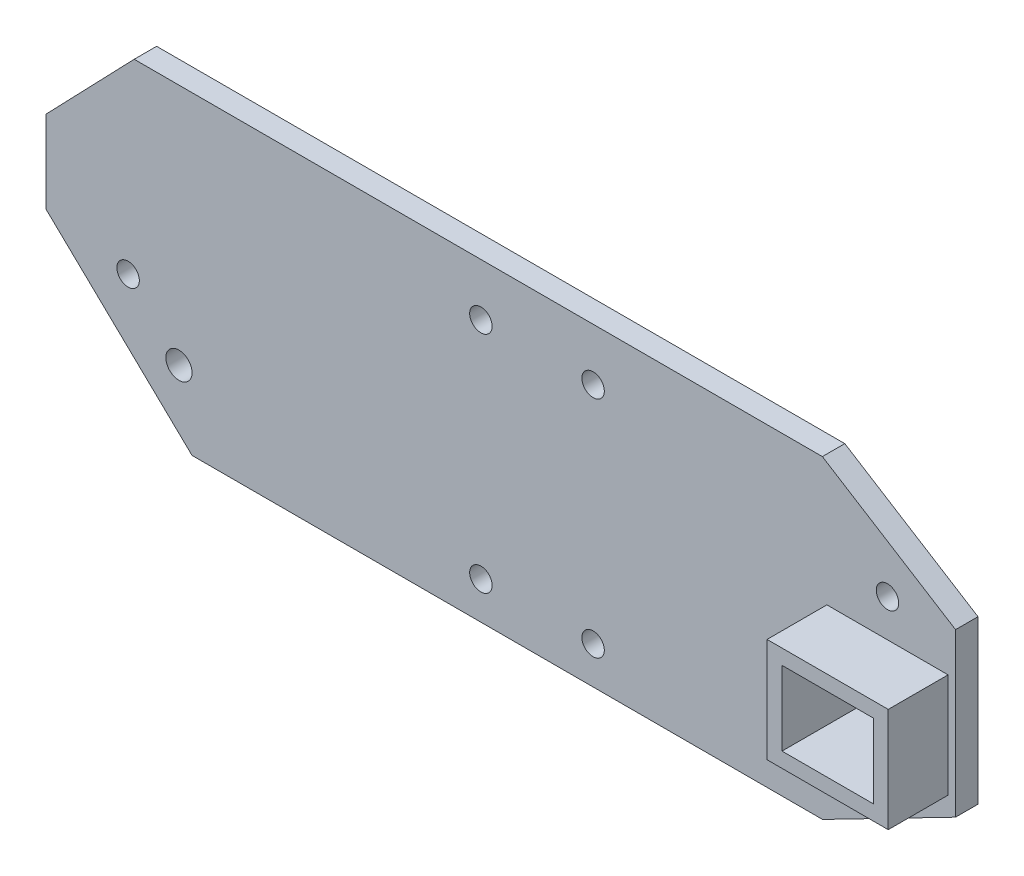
ISO-10303-21;
HEADER;
FILE_DESCRIPTION(('STEP AP214'),'2;1');
FILE_NAME('part.step','',(''),(''),'','','');
FILE_SCHEMA(('AUTOMOTIVE_DESIGN { 1 0 10303 214 1 1 1 1 }'));
ENDSEC;
DATA;
#1=APPLICATION_CONTEXT('core data for automotive mechanical design processes');
#2=APPLICATION_PROTOCOL_DEFINITION('international standard','automotive_design',2000,#1);
#3=PRODUCT_CONTEXT('',#1,'mechanical');
#4=PRODUCT('Part','Part','',(#3));
#5=PRODUCT_RELATED_PRODUCT_CATEGORY('part','',(#4));
#6=PRODUCT_DEFINITION_FORMATION('','',#4);
#7=PRODUCT_DEFINITION_CONTEXT('part definition',#1,'design');
#8=PRODUCT_DEFINITION('design','',#6,#7);
#9=PRODUCT_DEFINITION_SHAPE('','',#8);
#10=(LENGTH_UNIT() NAMED_UNIT(*) SI_UNIT(.MILLI.,.METRE.));
#11=(NAMED_UNIT(*) PLANE_ANGLE_UNIT() SI_UNIT($,.RADIAN.));
#12=(NAMED_UNIT(*) SI_UNIT($,.STERADIAN.) SOLID_ANGLE_UNIT());
#13=UNCERTAINTY_MEASURE_WITH_UNIT(LENGTH_MEASURE(1.E-05),#10,'distance_accuracy_value','');
#14=(GEOMETRIC_REPRESENTATION_CONTEXT(3) GLOBAL_UNCERTAINTY_ASSIGNED_CONTEXT((#13)) GLOBAL_UNIT_ASSIGNED_CONTEXT((#10,
#11,#12)) REPRESENTATION_CONTEXT('',''));
#15=CARTESIAN_POINT('',(0.,0.,0.));
#16=DIRECTION('',(0.,0.,1.));
#17=DIRECTION('',(1.,0.,0.));
#18=AXIS2_PLACEMENT_3D('',#15,#16,#17);
#19=CARTESIAN_POINT('',(0.,0.,3.));
#20=DIRECTION('',(0.,0.,1.));
#21=DIRECTION('',(1.,0.,0.));
#22=AXIS2_PLACEMENT_3D('',#19,#20,#21);
#23=PLANE('',#22);
#24=DIRECTION('',(-0.693449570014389,-0.720505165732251,0.));
#25=VECTOR('',#24,1.);
#26=CARTESIAN_POINT('',(-136.975246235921,26.6257818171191,3.));
#27=LINE('',#26,#25);
#28=CARTESIAN_POINT('',(-125.186603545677,38.8743696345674,3.));
#29=VERTEX_POINT('',#28);
#30=CARTESIAN_POINT('',(-136.975246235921,26.6257818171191,3.));
#31=VERTEX_POINT('',#30);
#32=EDGE_CURVE('E245',#29,#31,#27,.T.);
#33=ORIENTED_EDGE('',*,*,#32,.T.);
#34=DIRECTION('',(0.,-1.,0.));
#35=VECTOR('',#34,1.);
#36=CARTESIAN_POINT('',(-136.975246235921,15.6257818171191,3.));
#37=LINE('',#36,#35);
#38=CARTESIAN_POINT('',(-136.975246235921,15.6257818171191,3.));
#39=VERTEX_POINT('',#38);
#40=EDGE_CURVE('E248',#31,#39,#37,.T.);
#41=ORIENTED_EDGE('',*,*,#40,.T.);
#42=DIRECTION('',(0.721195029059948,-0.692732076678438,0.));
#43=VECTOR('',#42,1.);
#44=CARTESIAN_POINT('',(-117.453376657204,-3.12563036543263,3.));
#45=LINE('',#44,#43);
#46=CARTESIAN_POINT('',(-117.453376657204,-3.12563036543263,3.));
#47=VERTEX_POINT('',#46);
#48=EDGE_CURVE('E251',#39,#47,#45,.T.);
#49=ORIENTED_EDGE('',*,*,#48,.T.);
#50=DIRECTION('',(1.,0.,0.));
#51=VECTOR('',#50,1.);
#52=CARTESIAN_POINT('',(-117.453376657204,-3.12563036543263,3.));
#53=LINE('',#52,#51);
#54=CARTESIAN_POINT('',(-33.1633766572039,-3.12563036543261,3.));
#55=VERTEX_POINT('',#54);
#56=EDGE_CURVE('E253',#47,#55,#53,.T.);
#57=ORIENTED_EDGE('',*,*,#56,.T.);
#58=DIRECTION('',(0.889108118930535,0.457697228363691,0.));
#59=VECTOR('',#58,1.);
#60=CARTESIAN_POINT('',(-15.3812498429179,6.02829589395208,3.));
#61=LINE('',#60,#59);
#62=CARTESIAN_POINT('',(-15.3812498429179,6.02829589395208,3.));
#63=VERTEX_POINT('',#62);
#64=EDGE_CURVE('E255',#55,#63,#61,.T.);
#65=ORIENTED_EDGE('',*,*,#64,.T.);
#66=DIRECTION('',(0.,1.,0.));
#67=VECTOR('',#66,1.);
#68=CARTESIAN_POINT('',(-15.3812498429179,27.7402158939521,3.));
#69=LINE('',#68,#67);
#70=CARTESIAN_POINT('',(-15.3812498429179,27.7402158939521,3.));
#71=VERTEX_POINT('',#70);
#72=EDGE_CURVE('E257',#63,#71,#69,.T.);
#73=ORIENTED_EDGE('',*,*,#72,.T.);
#74=DIRECTION('',(-0.847873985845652,0.530197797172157,0.));
#75=VECTOR('',#74,1.);
#76=CARTESIAN_POINT('',(-33.1866035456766,38.8743696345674,3.));
#77=LINE('',#76,#75);
#78=CARTESIAN_POINT('',(-33.1866035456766,38.8743696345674,3.));
#79=VERTEX_POINT('',#78);
#80=EDGE_CURVE('E259',#71,#79,#77,.T.);
#81=ORIENTED_EDGE('',*,*,#80,.T.);
#82=DIRECTION('',(-1.,0.,0.));
#83=VECTOR('',#82,1.);
#84=CARTESIAN_POINT('',(-125.186603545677,38.8743696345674,3.));
#85=LINE('',#84,#83);
#86=EDGE_CURVE('E261',#79,#29,#85,.T.);
#87=ORIENTED_EDGE('',*,*,#86,.T.);
#88=EDGE_LOOP('',(#33,#41,#49,#57,#65,#73,#81,#87));
#89=FACE_BOUND('',#88,.T.);
#90=CARTESIAN_POINT('',(-24.4812498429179,27.0092558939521,3.));
#91=DIRECTION('',(0.,0.,1.));
#92=DIRECTION('',(1.,0.,0.));
#93=AXIS2_PLACEMENT_3D('',#90,#91,#92);
#94=CIRCLE('',#93,1.5);
#95=CARTESIAN_POINT('',(-22.9812498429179,27.0092558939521,3.));
#96=VERTEX_POINT('',#95);
#97=EDGE_CURVE('E235',#96,#96,#94,.T.);
#98=ORIENTED_EDGE('',*,*,#97,.F.);
#99=EDGE_LOOP('',(#98));
#100=FACE_BOUND('',#99,.T.);
#101=CARTESIAN_POINT('',(-63.8366035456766,31.8743696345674,3.));
#102=DIRECTION('',(0.,0.,-1.));
#103=DIRECTION('',(-1.,0.,0.));
#104=AXIS2_PLACEMENT_3D('',#101,#102,#103);
#105=CIRCLE('',#104,1.5);
#106=CARTESIAN_POINT('',(-65.3366035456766,31.8743696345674,3.));
#107=VERTEX_POINT('',#106);
#108=EDGE_CURVE('E232',#107,#107,#105,.T.);
#109=ORIENTED_EDGE('',*,*,#108,.T.);
#110=EDGE_LOOP('',(#109));
#111=FACE_BOUND('',#110,.T.);
#112=CARTESIAN_POINT('',(-78.8366035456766,1.87436963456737,3.));
#113=DIRECTION('',(0.,0.,-1.));
#114=DIRECTION('',(-1.,0.,0.));
#115=AXIS2_PLACEMENT_3D('',#112,#113,#114);
#116=CIRCLE('',#115,1.5);
#117=CARTESIAN_POINT('',(-80.3366035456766,1.87436963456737,3.));
#118=VERTEX_POINT('',#117);
#119=EDGE_CURVE('E227',#118,#118,#116,.T.);
#120=ORIENTED_EDGE('',*,*,#119,.T.);
#121=EDGE_LOOP('',(#120));
#122=FACE_BOUND('',#121,.T.);
#123=CARTESIAN_POINT('',(-63.8366035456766,1.87436963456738,3.));
#124=DIRECTION('',(0.,0.,-1.));
#125=DIRECTION('',(-1.,0.,0.));
#126=AXIS2_PLACEMENT_3D('',#123,#124,#125);
#127=CIRCLE('',#126,1.5);
#128=CARTESIAN_POINT('',(-65.3366035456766,1.87436963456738,3.));
#129=VERTEX_POINT('',#128);
#130=EDGE_CURVE('E221',#129,#129,#127,.T.);
#131=ORIENTED_EDGE('',*,*,#130,.T.);
#132=EDGE_LOOP('',(#131));
#133=FACE_BOUND('',#132,.T.);
#134=CARTESIAN_POINT('',(-78.8366035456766,31.8743696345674,3.));
#135=DIRECTION('',(0.,0.,-1.));
#136=DIRECTION('',(-1.,0.,0.));
#137=AXIS2_PLACEMENT_3D('',#134,#135,#136);
#138=CIRCLE('',#137,1.5);
#139=CARTESIAN_POINT('',(-80.3366035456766,31.8743696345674,3.));
#140=VERTEX_POINT('',#139);
#141=EDGE_CURVE('E214',#140,#140,#138,.T.);
#142=ORIENTED_EDGE('',*,*,#141,.T.);
#143=EDGE_LOOP('',(#142));
#144=FACE_BOUND('',#143,.T.);
#145=CARTESIAN_POINT('',(-119.199076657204,6.44436963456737,3.));
#146=DIRECTION('',(0.,0.,1.));
#147=DIRECTION('',(1.,0.,0.));
#148=AXIS2_PLACEMENT_3D('',#145,#146,#147);
#149=CIRCLE('',#148,1.7526);
#150=CARTESIAN_POINT('',(-117.446476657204,6.44436963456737,3.));
#151=VERTEX_POINT('',#150);
#152=EDGE_CURVE('E210',#151,#151,#149,.T.);
#153=ORIENTED_EDGE('',*,*,#152,.F.);
#154=EDGE_LOOP('',(#153));
#155=FACE_BOUND('',#154,.T.);
#156=CARTESIAN_POINT('',(-125.998946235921,13.5902818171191,3.));
#157=DIRECTION('',(0.,0.,1.));
#158=DIRECTION('',(1.,0.,0.));
#159=AXIS2_PLACEMENT_3D('',#156,#157,#158);
#160=CIRCLE('',#159,1.5);
#161=CARTESIAN_POINT('',(-124.498946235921,13.5902818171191,3.));
#162=VERTEX_POINT('',#161);
#163=EDGE_CURVE('E204',#162,#162,#160,.T.);
#164=ORIENTED_EDGE('',*,*,#163,.F.);
#165=EDGE_LOOP('',(#164));
#166=FACE_BOUND('',#165,.T.);
#167=DIRECTION('',(0.,1.,0.));
#168=VECTOR('',#167,1.);
#169=CARTESIAN_POINT('',(-16.3812498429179,22.0092558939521,3.));
#170=LINE('',#169,#168);
#171=CARTESIAN_POINT('',(-16.3812498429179,8.07925589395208,3.));
#172=VERTEX_POINT('',#171);
#173=CARTESIAN_POINT('',(-16.3812498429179,22.0092558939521,3.));
#174=VERTEX_POINT('',#173);
#175=EDGE_CURVE('E188',#172,#174,#170,.T.);
#176=ORIENTED_EDGE('',*,*,#175,.F.);
#177=DIRECTION('',(1.,0.,0.));
#178=VECTOR('',#177,1.);
#179=CARTESIAN_POINT('',(-16.3812498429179,8.07925589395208,3.));
#180=LINE('',#179,#178);
#181=CARTESIAN_POINT('',(-32.5812498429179,8.07925589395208,3.));
#182=VERTEX_POINT('',#181);
#183=EDGE_CURVE('E174',#182,#172,#180,.T.);
#184=ORIENTED_EDGE('',*,*,#183,.F.);
#185=DIRECTION('',(0.,-1.,0.));
#186=VECTOR('',#185,1.);
#187=CARTESIAN_POINT('',(-32.5812498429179,8.07925589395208,3.));
#188=LINE('',#187,#186);
#189=CARTESIAN_POINT('',(-32.5812498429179,22.0092558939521,3.));
#190=VERTEX_POINT('',#189);
#191=EDGE_CURVE('E179',#190,#182,#188,.T.);
#192=ORIENTED_EDGE('',*,*,#191,.F.);
#193=DIRECTION('',(-1.,0.,0.));
#194=VECTOR('',#193,1.);
#195=CARTESIAN_POINT('',(-32.5812498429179,22.0092558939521,3.));
#196=LINE('',#195,#194);
#197=EDGE_CURVE('E190',#174,#190,#196,.T.);
#198=ORIENTED_EDGE('',*,*,#197,.F.);
#199=EDGE_LOOP('',(#176,#184,#192,#198));
#200=FACE_BOUND('',#199,.T.);
#201=ADVANCED_FACE('F33',(#89,#100,#111,#122,#133,#144,#155,#166,#200),#23,.T.);
#202=CARTESIAN_POINT('',(-136.975246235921,26.6257818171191,3.));
#203=DIRECTION('',(0.720505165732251,-0.693449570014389,0.));
#204=DIRECTION('',(0.693449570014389,0.720505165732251,0.));
#205=AXIS2_PLACEMENT_3D('',#202,#203,#204);
#206=PLANE('',#205);
#207=DIRECTION('',(-0.693449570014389,-0.720505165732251,0.));
#208=VECTOR('',#207,1.);
#209=CARTESIAN_POINT('',(-136.975246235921,26.6257818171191,0.));
#210=LINE('',#209,#208);
#211=CARTESIAN_POINT('',(-125.186603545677,38.8743696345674,0.));
#212=VERTEX_POINT('',#211);
#213=CARTESIAN_POINT('',(-136.975246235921,26.6257818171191,0.));
#214=VERTEX_POINT('',#213);
#215=EDGE_CURVE('E242',#212,#214,#210,.T.);
#216=ORIENTED_EDGE('',*,*,#215,.T.);
#217=DIRECTION('',(0.,0.,-1.));
#218=VECTOR('',#217,1.);
#219=CARTESIAN_POINT('',(-136.975246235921,26.6257818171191,3.));
#220=LINE('',#219,#218);
#221=EDGE_CURVE('E299',#31,#214,#220,.T.);
#222=ORIENTED_EDGE('',*,*,#221,.F.);
#223=ORIENTED_EDGE('',*,*,#32,.F.);
#224=DIRECTION('',(0.,0.,-1.));
#225=VECTOR('',#224,1.);
#226=CARTESIAN_POINT('',(-125.186603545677,38.8743696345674,3.));
#227=LINE('',#226,#225);
#228=EDGE_CURVE('E263',#29,#212,#227,.T.);
#229=ORIENTED_EDGE('',*,*,#228,.T.);
#230=EDGE_LOOP('',(#216,#222,#223,#229));
#231=FACE_BOUND('',#230,.T.);
#232=ADVANCED_FACE('F35',(#231),#206,.F.);
#233=CARTESIAN_POINT('',(-136.975246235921,15.6257818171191,3.));
#234=DIRECTION('',(1.,0.,0.));
#235=DIRECTION('',(0.,0.,-1.));
#236=AXIS2_PLACEMENT_3D('',#233,#234,#235);
#237=PLANE('',#236);
#238=DIRECTION('',(0.,-1.,0.));
#239=VECTOR('',#238,1.);
#240=CARTESIAN_POINT('',(-136.975246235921,15.6257818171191,0.));
#241=LINE('',#240,#239);
#242=CARTESIAN_POINT('',(-136.975246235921,15.6257818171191,0.));
#243=VERTEX_POINT('',#242);
#244=EDGE_CURVE('E266',#214,#243,#241,.T.);
#245=ORIENTED_EDGE('',*,*,#244,.T.);
#246=DIRECTION('',(0.,0.,-1.));
#247=VECTOR('',#246,1.);
#248=CARTESIAN_POINT('',(-136.975246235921,15.6257818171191,3.));
#249=LINE('',#248,#247);
#250=EDGE_CURVE('E296',#39,#243,#249,.T.);
#251=ORIENTED_EDGE('',*,*,#250,.F.);
#252=ORIENTED_EDGE('',*,*,#40,.F.);
#253=ORIENTED_EDGE('',*,*,#221,.T.);
#254=EDGE_LOOP('',(#245,#251,#252,#253));
#255=FACE_BOUND('',#254,.T.);
#256=ADVANCED_FACE('F331',(#255),#237,.F.);
#257=CARTESIAN_POINT('',(-117.453376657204,-3.12563036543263,3.));
#258=DIRECTION('',(0.692732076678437,0.721195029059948,0.));
#259=DIRECTION('',(-0.721195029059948,0.692732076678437,0.));
#260=AXIS2_PLACEMENT_3D('',#257,#258,#259);
#261=PLANE('',#260);
#262=DIRECTION('',(0.721195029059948,-0.692732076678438,0.));
#263=VECTOR('',#262,1.);
#264=CARTESIAN_POINT('',(-117.453376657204,-3.12563036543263,0.));
#265=LINE('',#264,#263);
#266=CARTESIAN_POINT('',(-117.453376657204,-3.12563036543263,0.));
#267=VERTEX_POINT('',#266);
#268=EDGE_CURVE('E268',#243,#267,#265,.T.);
#269=ORIENTED_EDGE('',*,*,#268,.T.);
#270=DIRECTION('',(0.,0.,-1.));
#271=VECTOR('',#270,1.);
#272=CARTESIAN_POINT('',(-117.453376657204,-3.12563036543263,3.));
#273=LINE('',#272,#271);
#274=EDGE_CURVE('E293',#47,#267,#273,.T.);
#275=ORIENTED_EDGE('',*,*,#274,.F.);
#276=ORIENTED_EDGE('',*,*,#48,.F.);
#277=ORIENTED_EDGE('',*,*,#250,.T.);
#278=EDGE_LOOP('',(#269,#275,#276,#277));
#279=FACE_BOUND('',#278,.T.);
#280=ADVANCED_FACE('F353',(#279),#261,.F.);
#281=CARTESIAN_POINT('',(-117.453376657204,-3.12563036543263,3.));
#282=DIRECTION('',(0.,1.,0.));
#283=DIRECTION('',(-1.,0.,0.));
#284=AXIS2_PLACEMENT_3D('',#281,#282,#283);
#285=PLANE('',#284);
#286=DIRECTION('',(1.,0.,0.));
#287=VECTOR('',#286,1.);
#288=CARTESIAN_POINT('',(-117.453376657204,-3.12563036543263,0.));
#289=LINE('',#288,#287);
#290=CARTESIAN_POINT('',(-33.1633766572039,-3.12563036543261,0.));
#291=VERTEX_POINT('',#290);
#292=EDGE_CURVE('E270',#267,#291,#289,.T.);
#293=ORIENTED_EDGE('',*,*,#292,.T.);
#294=DIRECTION('',(0.,0.,-1.));
#295=VECTOR('',#294,1.);
#296=CARTESIAN_POINT('',(-33.1633766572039,-3.12563036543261,3.));
#297=LINE('',#296,#295);
#298=EDGE_CURVE('E290',#55,#291,#297,.T.);
#299=ORIENTED_EDGE('',*,*,#298,.F.);
#300=ORIENTED_EDGE('',*,*,#56,.F.);
#301=ORIENTED_EDGE('',*,*,#274,.T.);
#302=EDGE_LOOP('',(#293,#299,#300,#301));
#303=FACE_BOUND('',#302,.T.);
#304=ADVANCED_FACE('F349',(#303),#285,.F.);
#305=CARTESIAN_POINT('',(-15.3812498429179,6.02829589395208,3.));
#306=DIRECTION('',(-0.457697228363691,0.889108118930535,0.));
#307=DIRECTION('',(-0.889108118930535,-0.457697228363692,0.));
#308=AXIS2_PLACEMENT_3D('',#305,#306,#307);
#309=PLANE('',#308);
#310=DIRECTION('',(0.889108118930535,0.457697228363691,0.));
#311=VECTOR('',#310,1.);
#312=CARTESIAN_POINT('',(-15.3812498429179,6.02829589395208,0.));
#313=LINE('',#312,#311);
#314=CARTESIAN_POINT('',(-15.3812498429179,6.02829589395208,0.));
#315=VERTEX_POINT('',#314);
#316=EDGE_CURVE('E272',#291,#315,#313,.T.);
#317=ORIENTED_EDGE('',*,*,#316,.T.);
#318=DIRECTION('',(0.,0.,-1.));
#319=VECTOR('',#318,1.);
#320=CARTESIAN_POINT('',(-15.3812498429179,6.02829589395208,3.));
#321=LINE('',#320,#319);
#322=EDGE_CURVE('E287',#63,#315,#321,.T.);
#323=ORIENTED_EDGE('',*,*,#322,.F.);
#324=ORIENTED_EDGE('',*,*,#64,.F.);
#325=ORIENTED_EDGE('',*,*,#298,.T.);
#326=EDGE_LOOP('',(#317,#323,#324,#325));
#327=FACE_BOUND('',#326,.T.);
#328=ADVANCED_FACE('F345',(#327),#309,.F.);
#329=CARTESIAN_POINT('',(-15.3812498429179,27.7402158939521,3.));
#330=DIRECTION('',(-1.,0.,0.));
#331=DIRECTION('',(0.,0.,1.));
#332=AXIS2_PLACEMENT_3D('',#329,#330,#331);
#333=PLANE('',#332);
#334=DIRECTION('',(0.,1.,0.));
#335=VECTOR('',#334,1.);
#336=CARTESIAN_POINT('',(-15.3812498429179,27.7402158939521,0.));
#337=LINE('',#336,#335);
#338=CARTESIAN_POINT('',(-15.3812498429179,27.7402158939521,0.));
#339=VERTEX_POINT('',#338);
#340=EDGE_CURVE('E274',#315,#339,#337,.T.);
#341=ORIENTED_EDGE('',*,*,#340,.T.);
#342=DIRECTION('',(0.,0.,-1.));
#343=VECTOR('',#342,1.);
#344=CARTESIAN_POINT('',(-15.3812498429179,27.7402158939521,3.));
#345=LINE('',#344,#343);
#346=EDGE_CURVE('E284',#71,#339,#345,.T.);
#347=ORIENTED_EDGE('',*,*,#346,.F.);
#348=ORIENTED_EDGE('',*,*,#72,.F.);
#349=ORIENTED_EDGE('',*,*,#322,.T.);
#350=EDGE_LOOP('',(#341,#347,#348,#349));
#351=FACE_BOUND('',#350,.T.);
#352=ADVANCED_FACE('F341',(#351),#333,.F.);
#353=CARTESIAN_POINT('',(-33.1866035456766,38.8743696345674,3.));
#354=DIRECTION('',(-0.530197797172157,-0.847873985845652,0.));
#355=DIRECTION('',(0.847873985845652,-0.530197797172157,0.));
#356=AXIS2_PLACEMENT_3D('',#353,#354,#355);
#357=PLANE('',#356);
#358=DIRECTION('',(-0.847873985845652,0.530197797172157,0.));
#359=VECTOR('',#358,1.);
#360=CARTESIAN_POINT('',(-33.1866035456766,38.8743696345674,0.));
#361=LINE('',#360,#359);
#362=CARTESIAN_POINT('',(-33.1866035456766,38.8743696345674,0.));
#363=VERTEX_POINT('',#362);
#364=EDGE_CURVE('E276',#339,#363,#361,.T.);
#365=ORIENTED_EDGE('',*,*,#364,.T.);
#366=DIRECTION('',(0.,0.,-1.));
#367=VECTOR('',#366,1.);
#368=CARTESIAN_POINT('',(-33.1866035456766,38.8743696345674,3.));
#369=LINE('',#368,#367);
#370=EDGE_CURVE('E281',#79,#363,#369,.T.);
#371=ORIENTED_EDGE('',*,*,#370,.F.);
#372=ORIENTED_EDGE('',*,*,#80,.F.);
#373=ORIENTED_EDGE('',*,*,#346,.T.);
#374=EDGE_LOOP('',(#365,#371,#372,#373));
#375=FACE_BOUND('',#374,.T.);
#376=ADVANCED_FACE('F337',(#375),#357,.F.);
#377=CARTESIAN_POINT('',(-125.186603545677,38.8743696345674,3.));
#378=DIRECTION('',(0.,-1.,0.));
#379=DIRECTION('',(0.,0.,-1.));
#380=AXIS2_PLACEMENT_3D('',#377,#378,#379);
#381=PLANE('',#380);
#382=DIRECTION('',(-1.,0.,0.));
#383=VECTOR('',#382,1.);
#384=CARTESIAN_POINT('',(-125.186603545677,38.8743696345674,0.));
#385=LINE('',#384,#383);
#386=EDGE_CURVE('E249',#363,#212,#385,.T.);
#387=ORIENTED_EDGE('',*,*,#386,.T.);
#388=ORIENTED_EDGE('',*,*,#228,.F.);
#389=ORIENTED_EDGE('',*,*,#86,.F.);
#390=ORIENTED_EDGE('',*,*,#370,.T.);
#391=EDGE_LOOP('',(#387,#388,#389,#390));
#392=FACE_BOUND('',#391,.T.);
#393=ADVANCED_FACE('F321',(#392),#381,.F.);
#394=CARTESIAN_POINT('',(0.,0.,0.));
#395=DIRECTION('',(0.,0.,1.));
#396=DIRECTION('',(1.,0.,0.));
#397=AXIS2_PLACEMENT_3D('',#394,#395,#396);
#398=PLANE('',#397);
#399=CARTESIAN_POINT('',(-125.998946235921,13.5902818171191,0.));
#400=DIRECTION('',(0.,0.,-1.));
#401=DIRECTION('',(-1.,0.,0.));
#402=AXIS2_PLACEMENT_3D('',#399,#400,#401);
#403=CIRCLE('',#402,1.5);
#404=CARTESIAN_POINT('',(-127.498946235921,13.5902818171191,0.));
#405=VERTEX_POINT('',#404);
#406=EDGE_CURVE('E201',#405,#405,#403,.T.);
#407=ORIENTED_EDGE('',*,*,#406,.F.);
#408=EDGE_LOOP('',(#407));
#409=FACE_BOUND('',#408,.T.);
#410=CARTESIAN_POINT('',(-119.199076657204,6.44436963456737,0.));
#411=DIRECTION('',(0.,0.,-1.));
#412=DIRECTION('',(-1.,0.,0.));
#413=AXIS2_PLACEMENT_3D('',#410,#411,#412);
#414=CIRCLE('',#413,1.7526);
#415=CARTESIAN_POINT('',(-120.951676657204,6.44436963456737,0.));
#416=VERTEX_POINT('',#415);
#417=EDGE_CURVE('E207',#416,#416,#414,.T.);
#418=ORIENTED_EDGE('',*,*,#417,.F.);
#419=EDGE_LOOP('',(#418));
#420=FACE_BOUND('',#419,.T.);
#421=CARTESIAN_POINT('',(-78.8366035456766,31.8743696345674,0.));
#422=DIRECTION('',(0.,0.,-1.));
#423=DIRECTION('',(-1.,0.,0.));
#424=AXIS2_PLACEMENT_3D('',#421,#422,#423);
#425=CIRCLE('',#424,1.5);
#426=CARTESIAN_POINT('',(-80.3366035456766,31.8743696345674,0.));
#427=VERTEX_POINT('',#426);
#428=EDGE_CURVE('E218',#427,#427,#425,.T.);
#429=ORIENTED_EDGE('',*,*,#428,.F.);
#430=EDGE_LOOP('',(#429));
#431=FACE_BOUND('',#430,.T.);
#432=CARTESIAN_POINT('',(-63.8366035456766,1.87436963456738,0.));
#433=DIRECTION('',(0.,0.,-1.));
#434=DIRECTION('',(-1.,0.,0.));
#435=AXIS2_PLACEMENT_3D('',#432,#433,#434);
#436=CIRCLE('',#435,1.5);
#437=CARTESIAN_POINT('',(-65.3366035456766,1.87436963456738,0.));
#438=VERTEX_POINT('',#437);
#439=EDGE_CURVE('E224',#438,#438,#436,.T.);
#440=ORIENTED_EDGE('',*,*,#439,.F.);
#441=EDGE_LOOP('',(#440));
#442=FACE_BOUND('',#441,.T.);
#443=CARTESIAN_POINT('',(-78.8366035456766,1.87436963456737,0.));
#444=DIRECTION('',(0.,0.,-1.));
#445=DIRECTION('',(-1.,0.,0.));
#446=AXIS2_PLACEMENT_3D('',#443,#444,#445);
#447=CIRCLE('',#446,1.5);
#448=CARTESIAN_POINT('',(-80.3366035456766,1.87436963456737,0.));
#449=VERTEX_POINT('',#448);
#450=EDGE_CURVE('E213',#449,#449,#447,.T.);
#451=ORIENTED_EDGE('',*,*,#450,.F.);
#452=EDGE_LOOP('',(#451));
#453=FACE_BOUND('',#452,.T.);
#454=CARTESIAN_POINT('',(-63.8366035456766,31.8743696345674,0.));
#455=DIRECTION('',(0.,0.,-1.));
#456=DIRECTION('',(-1.,0.,0.));
#457=AXIS2_PLACEMENT_3D('',#454,#455,#456);
#458=CIRCLE('',#457,1.5);
#459=CARTESIAN_POINT('',(-65.3366035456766,31.8743696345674,0.));
#460=VERTEX_POINT('',#459);
#461=EDGE_CURVE('E217',#460,#460,#458,.T.);
#462=ORIENTED_EDGE('',*,*,#461,.F.);
#463=EDGE_LOOP('',(#462));
#464=FACE_BOUND('',#463,.T.);
#465=CARTESIAN_POINT('',(-24.4812498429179,27.0092558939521,0.));
#466=DIRECTION('',(0.,0.,1.));
#467=DIRECTION('',(1.,0.,0.));
#468=AXIS2_PLACEMENT_3D('',#465,#466,#467);
#469=CIRCLE('',#468,1.5);
#470=CARTESIAN_POINT('',(-22.9812498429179,27.0092558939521,0.));
#471=VERTEX_POINT('',#470);
#472=EDGE_CURVE('E37',#471,#471,#469,.T.);
#473=ORIENTED_EDGE('',*,*,#472,.T.);
#474=EDGE_LOOP('',(#473));
#475=FACE_BOUND('',#474,.T.);
#476=DIRECTION('',(0.,1.,0.));
#477=VECTOR('',#476,1.);
#478=CARTESIAN_POINT('',(-18.3812498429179,0.,0.));
#479=LINE('',#478,#477);
#480=CARTESIAN_POINT('',(-18.3812498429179,10.0792558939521,0.));
#481=VERTEX_POINT('',#480);
#482=CARTESIAN_POINT('',(-18.3812498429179,20.0092558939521,0.));
#483=VERTEX_POINT('',#482);
#484=EDGE_CURVE('E42',#481,#483,#479,.T.);
#485=ORIENTED_EDGE('',*,*,#484,.T.);
#486=DIRECTION('',(-1.,0.,0.));
#487=VECTOR('',#486,1.);
#488=CARTESIAN_POINT('',(0.,20.0092558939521,0.));
#489=LINE('',#488,#487);
#490=CARTESIAN_POINT('',(-30.5812498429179,20.0092558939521,0.));
#491=VERTEX_POINT('',#490);
#492=EDGE_CURVE('E11',#483,#491,#489,.T.);
#493=ORIENTED_EDGE('',*,*,#492,.T.);
#494=DIRECTION('',(0.,-1.,0.));
#495=VECTOR('',#494,1.);
#496=CARTESIAN_POINT('',(-30.5812498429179,0.,0.));
#497=LINE('',#496,#495);
#498=CARTESIAN_POINT('',(-30.5812498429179,10.0792558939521,0.));
#499=VERTEX_POINT('',#498);
#500=EDGE_CURVE('E302',#491,#499,#497,.T.);
#501=ORIENTED_EDGE('',*,*,#500,.T.);
#502=DIRECTION('',(1.,0.,0.));
#503=VECTOR('',#502,1.);
#504=CARTESIAN_POINT('',(0.,10.0792558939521,0.));
#505=LINE('',#504,#503);
#506=EDGE_CURVE('E153',#499,#481,#505,.T.);
#507=ORIENTED_EDGE('',*,*,#506,.T.);
#508=EDGE_LOOP('',(#485,#493,#501,#507));
#509=FACE_BOUND('',#508,.T.);
#510=ORIENTED_EDGE('',*,*,#215,.F.);
#511=ORIENTED_EDGE('',*,*,#386,.F.);
#512=ORIENTED_EDGE('',*,*,#364,.F.);
#513=ORIENTED_EDGE('',*,*,#340,.F.);
#514=ORIENTED_EDGE('',*,*,#316,.F.);
#515=ORIENTED_EDGE('',*,*,#292,.F.);
#516=ORIENTED_EDGE('',*,*,#268,.F.);
#517=ORIENTED_EDGE('',*,*,#244,.F.);
#518=EDGE_LOOP('',(#510,#511,#512,#513,#514,#515,#516,#517));
#519=FACE_BOUND('',#518,.T.);
#520=ADVANCED_FACE('F307',(#409,#420,#431,#442,#453,#464,#475,#509,#519),#398,.F.);
#521=CARTESIAN_POINT('',(-18.3812498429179,20.0092558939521,-2.));
#522=DIRECTION('',(0.,1.,0.));
#523=DIRECTION('',(-1.,0.,0.));
#524=AXIS2_PLACEMENT_3D('',#521,#522,#523);
#525=PLANE('',#524);
#526=DIRECTION('',(0.,0.,1.));
#527=VECTOR('',#526,1.);
#528=CARTESIAN_POINT('',(-18.3812498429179,20.0092558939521,-2.));
#529=LINE('',#528,#527);
#530=CARTESIAN_POINT('',(-18.3812498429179,20.0092558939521,11.));
#531=VERTEX_POINT('',#530);
#532=EDGE_CURVE('E240',#483,#531,#529,.T.);
#533=ORIENTED_EDGE('',*,*,#532,.T.);
#534=DIRECTION('',(-1.,0.,0.));
#535=VECTOR('',#534,1.);
#536=CARTESIAN_POINT('',(-30.5812498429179,20.0092558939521,11.));
#537=LINE('',#536,#535);
#538=CARTESIAN_POINT('',(-30.5812498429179,20.0092558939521,11.));
#539=VERTEX_POINT('',#538);
#540=EDGE_CURVE('E170',#531,#539,#537,.T.);
#541=ORIENTED_EDGE('',*,*,#540,.T.);
#542=DIRECTION('',(0.,0.,1.));
#543=VECTOR('',#542,1.);
#544=CARTESIAN_POINT('',(-30.5812498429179,20.0092558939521,-2.));
#545=LINE('',#544,#543);
#546=EDGE_CURVE('E156',#491,#539,#545,.T.);
#547=ORIENTED_EDGE('',*,*,#546,.F.);
#548=ORIENTED_EDGE('',*,*,#492,.F.);
#549=EDGE_LOOP('',(#533,#541,#547,#548));
#550=FACE_BOUND('',#549,.T.);
#551=ADVANCED_FACE('F313',(#550),#525,.F.);
#552=CARTESIAN_POINT('',(-18.3812498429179,10.0792558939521,-2.));
#553=DIRECTION('',(1.,0.,0.));
#554=DIRECTION('',(0.,1.,0.));
#555=AXIS2_PLACEMENT_3D('',#552,#553,#554);
#556=PLANE('',#555);
#557=DIRECTION('',(0.,0.,1.));
#558=VECTOR('',#557,1.);
#559=CARTESIAN_POINT('',(-18.3812498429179,10.0792558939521,-2.));
#560=LINE('',#559,#558);
#561=CARTESIAN_POINT('',(-18.3812498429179,10.0792558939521,11.));
#562=VERTEX_POINT('',#561);
#563=EDGE_CURVE('E155',#481,#562,#560,.T.);
#564=ORIENTED_EDGE('',*,*,#563,.T.);
#565=DIRECTION('',(0.,1.,0.));
#566=VECTOR('',#565,1.);
#567=CARTESIAN_POINT('',(-18.3812498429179,20.0092558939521,11.));
#568=LINE('',#567,#566);
#569=EDGE_CURVE('E168',#562,#531,#568,.T.);
#570=ORIENTED_EDGE('',*,*,#569,.T.);
#571=ORIENTED_EDGE('',*,*,#532,.F.);
#572=ORIENTED_EDGE('',*,*,#484,.F.);
#573=EDGE_LOOP('',(#564,#570,#571,#572));
#574=FACE_BOUND('',#573,.T.);
#575=ADVANCED_FACE('F311',(#574),#556,.F.);
#576=CARTESIAN_POINT('',(-30.5812498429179,10.0792558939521,-2.));
#577=DIRECTION('',(0.,-1.,0.));
#578=DIRECTION('',(1.,0.,0.));
#579=AXIS2_PLACEMENT_3D('',#576,#577,#578);
#580=PLANE('',#579);
#581=DIRECTION('',(0.,0.,1.));
#582=VECTOR('',#581,1.);
#583=CARTESIAN_POINT('',(-30.5812498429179,10.0792558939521,-2.));
#584=LINE('',#583,#582);
#585=CARTESIAN_POINT('',(-30.5812498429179,10.0792558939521,11.));
#586=VERTEX_POINT('',#585);
#587=EDGE_CURVE('E57',#499,#586,#584,.T.);
#588=ORIENTED_EDGE('',*,*,#587,.T.);
#589=DIRECTION('',(1.,0.,0.));
#590=VECTOR('',#589,1.);
#591=CARTESIAN_POINT('',(-18.3812498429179,10.0792558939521,11.));
#592=LINE('',#591,#590);
#593=EDGE_CURVE('E150',#586,#562,#592,.T.);
#594=ORIENTED_EDGE('',*,*,#593,.T.);
#595=ORIENTED_EDGE('',*,*,#563,.F.);
#596=ORIENTED_EDGE('',*,*,#506,.F.);
#597=EDGE_LOOP('',(#588,#594,#595,#596));
#598=FACE_BOUND('',#597,.T.);
#599=ADVANCED_FACE('F147',(#598),#580,.F.);
#600=CARTESIAN_POINT('',(-30.5812498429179,20.0092558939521,-2.));
#601=DIRECTION('',(-1.,0.,0.));
#602=DIRECTION('',(0.,-1.,0.));
#603=AXIS2_PLACEMENT_3D('',#600,#601,#602);
#604=PLANE('',#603);
#605=ORIENTED_EDGE('',*,*,#546,.T.);
#606=DIRECTION('',(0.,-1.,0.));
#607=VECTOR('',#606,1.);
#608=CARTESIAN_POINT('',(-30.5812498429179,10.0792558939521,11.));
#609=LINE('',#608,#607);
#610=EDGE_CURVE('E159',#539,#586,#609,.T.);
#611=ORIENTED_EDGE('',*,*,#610,.T.);
#612=ORIENTED_EDGE('',*,*,#587,.F.);
#613=ORIENTED_EDGE('',*,*,#500,.F.);
#614=EDGE_LOOP('',(#605,#611,#612,#613));
#615=FACE_BOUND('',#614,.T.);
#616=ADVANCED_FACE('F160',(#615),#604,.F.);
#617=CARTESIAN_POINT('',(-24.4812498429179,27.0092558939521,-2.));
#618=DIRECTION('',(0.,0.,1.));
#619=DIRECTION('',(1.,0.,0.));
#620=AXIS2_PLACEMENT_3D('',#617,#618,#619);
#621=CYLINDRICAL_SURFACE('',#620,1.5);
#622=ORIENTED_EDGE('',*,*,#97,.T.);
#623=EDGE_LOOP('',(#622));
#624=FACE_BOUND('',#623,.T.);
#625=ORIENTED_EDGE('',*,*,#472,.F.);
#626=EDGE_LOOP('',(#625));
#627=FACE_BOUND('',#626,.T.);
#628=ADVANCED_FACE('F475',(#624,#627),#621,.F.);
#629=CARTESIAN_POINT('',(-63.8366035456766,31.8743696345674,3.));
#630=DIRECTION('',(0.,0.,-1.));
#631=DIRECTION('',(-1.,0.,0.));
#632=AXIS2_PLACEMENT_3D('',#629,#630,#631);
#633=CYLINDRICAL_SURFACE('',#632,1.5);
#634=ORIENTED_EDGE('',*,*,#108,.F.);
#635=EDGE_LOOP('',(#634));
#636=FACE_BOUND('',#635,.T.);
#637=ORIENTED_EDGE('',*,*,#461,.T.);
#638=EDGE_LOOP('',(#637));
#639=FACE_BOUND('',#638,.T.);
#640=ADVANCED_FACE('F537',(#636,#639),#633,.F.);
#641=CARTESIAN_POINT('',(-78.8366035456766,1.87436963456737,3.));
#642=DIRECTION('',(0.,0.,-1.));
#643=DIRECTION('',(-1.,0.,0.));
#644=AXIS2_PLACEMENT_3D('',#641,#642,#643);
#645=CYLINDRICAL_SURFACE('',#644,1.5);
#646=ORIENTED_EDGE('',*,*,#119,.F.);
#647=EDGE_LOOP('',(#646));
#648=FACE_BOUND('',#647,.T.);
#649=ORIENTED_EDGE('',*,*,#450,.T.);
#650=EDGE_LOOP('',(#649));
#651=FACE_BOUND('',#650,.T.);
#652=ADVANCED_FACE('F533',(#648,#651),#645,.F.);
#653=CARTESIAN_POINT('',(-63.8366035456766,1.87436963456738,3.));
#654=DIRECTION('',(0.,0.,-1.));
#655=DIRECTION('',(-1.,0.,0.));
#656=AXIS2_PLACEMENT_3D('',#653,#654,#655);
#657=CYLINDRICAL_SURFACE('',#656,1.5);
#658=ORIENTED_EDGE('',*,*,#130,.F.);
#659=EDGE_LOOP('',(#658));
#660=FACE_BOUND('',#659,.T.);
#661=ORIENTED_EDGE('',*,*,#439,.T.);
#662=EDGE_LOOP('',(#661));
#663=FACE_BOUND('',#662,.T.);
#664=ADVANCED_FACE('F529',(#660,#663),#657,.F.);
#665=CARTESIAN_POINT('',(-78.8366035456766,31.8743696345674,3.));
#666=DIRECTION('',(0.,0.,-1.));
#667=DIRECTION('',(-1.,0.,0.));
#668=AXIS2_PLACEMENT_3D('',#665,#666,#667);
#669=CYLINDRICAL_SURFACE('',#668,1.5);
#670=ORIENTED_EDGE('',*,*,#141,.F.);
#671=EDGE_LOOP('',(#670));
#672=FACE_BOUND('',#671,.T.);
#673=ORIENTED_EDGE('',*,*,#428,.T.);
#674=EDGE_LOOP('',(#673));
#675=FACE_BOUND('',#674,.T.);
#676=ADVANCED_FACE('F421',(#672,#675),#669,.F.);
#677=CARTESIAN_POINT('',(-119.199076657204,6.44436963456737,5.));
#678=DIRECTION('',(0.,0.,-1.));
#679=DIRECTION('',(-1.,0.,0.));
#680=AXIS2_PLACEMENT_3D('',#677,#678,#679);
#681=CYLINDRICAL_SURFACE('',#680,1.7526);
#682=ORIENTED_EDGE('',*,*,#152,.T.);
#683=EDGE_LOOP('',(#682));
#684=FACE_BOUND('',#683,.T.);
#685=ORIENTED_EDGE('',*,*,#417,.T.);
#686=EDGE_LOOP('',(#685));
#687=FACE_BOUND('',#686,.T.);
#688=ADVANCED_FACE('F426',(#684,#687),#681,.F.);
#689=CARTESIAN_POINT('',(-125.998946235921,13.5902818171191,5.));
#690=DIRECTION('',(0.,0.,-1.));
#691=DIRECTION('',(-1.,0.,0.));
#692=AXIS2_PLACEMENT_3D('',#689,#690,#691);
#693=CYLINDRICAL_SURFACE('',#692,1.5);
#694=ORIENTED_EDGE('',*,*,#163,.T.);
#695=EDGE_LOOP('',(#694));
#696=FACE_BOUND('',#695,.T.);
#697=ORIENTED_EDGE('',*,*,#406,.T.);
#698=EDGE_LOOP('',(#697));
#699=FACE_BOUND('',#698,.T.);
#700=ADVANCED_FACE('F431',(#696,#699),#693,.F.);
#701=CARTESIAN_POINT('',(0.,0.,11.));
#702=DIRECTION('',(0.,0.,-1.));
#703=DIRECTION('',(-1.,0.,0.));
#704=AXIS2_PLACEMENT_3D('',#701,#702,#703);
#705=PLANE('',#704);
#706=DIRECTION('',(1.,0.,0.));
#707=VECTOR('',#706,1.);
#708=CARTESIAN_POINT('',(-16.3812498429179,8.07925589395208,11.));
#709=LINE('',#708,#707);
#710=CARTESIAN_POINT('',(-32.5812498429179,8.07925589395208,11.));
#711=VERTEX_POINT('',#710);
#712=CARTESIAN_POINT('',(-16.3812498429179,8.07925589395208,11.));
#713=VERTEX_POINT('',#712);
#714=EDGE_CURVE('E175',#711,#713,#709,.T.);
#715=ORIENTED_EDGE('',*,*,#714,.T.);
#716=DIRECTION('',(0.,1.,0.));
#717=VECTOR('',#716,1.);
#718=CARTESIAN_POINT('',(-16.3812498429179,22.0092558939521,11.));
#719=LINE('',#718,#717);
#720=CARTESIAN_POINT('',(-16.3812498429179,22.0092558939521,11.));
#721=VERTEX_POINT('',#720);
#722=EDGE_CURVE('E178',#713,#721,#719,.T.);
#723=ORIENTED_EDGE('',*,*,#722,.T.);
#724=DIRECTION('',(-1.,0.,0.));
#725=VECTOR('',#724,1.);
#726=CARTESIAN_POINT('',(-32.5812498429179,22.0092558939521,11.));
#727=LINE('',#726,#725);
#728=CARTESIAN_POINT('',(-32.5812498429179,22.0092558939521,11.));
#729=VERTEX_POINT('',#728);
#730=EDGE_CURVE('E181',#721,#729,#727,.T.);
#731=ORIENTED_EDGE('',*,*,#730,.T.);
#732=DIRECTION('',(0.,-1.,0.));
#733=VECTOR('',#732,1.);
#734=CARTESIAN_POINT('',(-32.5812498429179,8.07925589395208,11.));
#735=LINE('',#734,#733);
#736=EDGE_CURVE('E183',#729,#711,#735,.T.);
#737=ORIENTED_EDGE('',*,*,#736,.T.);
#738=EDGE_LOOP('',(#715,#723,#731,#737));
#739=FACE_BOUND('',#738,.T.);
#740=ORIENTED_EDGE('',*,*,#610,.F.);
#741=ORIENTED_EDGE('',*,*,#540,.F.);
#742=ORIENTED_EDGE('',*,*,#569,.F.);
#743=ORIENTED_EDGE('',*,*,#593,.F.);
#744=EDGE_LOOP('',(#740,#741,#742,#743));
#745=FACE_BOUND('',#744,.T.);
#746=ADVANCED_FACE('F166',(#739,#745),#705,.F.);
#747=CARTESIAN_POINT('',(-16.3812498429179,8.07925589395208,11.));
#748=DIRECTION('',(0.,1.,0.));
#749=DIRECTION('',(-1.,0.,0.));
#750=AXIS2_PLACEMENT_3D('',#747,#748,#749);
#751=PLANE('',#750);
#752=ORIENTED_EDGE('',*,*,#183,.T.);
#753=DIRECTION('',(0.,0.,-1.));
#754=VECTOR('',#753,1.);
#755=CARTESIAN_POINT('',(-16.3812498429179,8.07925589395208,11.));
#756=LINE('',#755,#754);
#757=EDGE_CURVE('E199',#713,#172,#756,.T.);
#758=ORIENTED_EDGE('',*,*,#757,.F.);
#759=ORIENTED_EDGE('',*,*,#714,.F.);
#760=DIRECTION('',(0.,0.,-1.));
#761=VECTOR('',#760,1.);
#762=CARTESIAN_POINT('',(-32.5812498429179,8.07925589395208,11.));
#763=LINE('',#762,#761);
#764=EDGE_CURVE('E185',#711,#182,#763,.T.);
#765=ORIENTED_EDGE('',*,*,#764,.T.);
#766=EDGE_LOOP('',(#752,#758,#759,#765));
#767=FACE_BOUND('',#766,.T.);
#768=ADVANCED_FACE('F484',(#767),#751,.F.);
#769=CARTESIAN_POINT('',(-16.3812498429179,22.0092558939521,11.));
#770=DIRECTION('',(-1.,0.,0.));
#771=DIRECTION('',(0.,0.,1.));
#772=AXIS2_PLACEMENT_3D('',#769,#770,#771);
#773=PLANE('',#772);
#774=ORIENTED_EDGE('',*,*,#175,.T.);
#775=DIRECTION('',(0.,0.,-1.));
#776=VECTOR('',#775,1.);
#777=CARTESIAN_POINT('',(-16.3812498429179,22.0092558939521,11.));
#778=LINE('',#777,#776);
#779=EDGE_CURVE('E196',#721,#174,#778,.T.);
#780=ORIENTED_EDGE('',*,*,#779,.F.);
#781=ORIENTED_EDGE('',*,*,#722,.F.);
#782=ORIENTED_EDGE('',*,*,#757,.T.);
#783=EDGE_LOOP('',(#774,#780,#781,#782));
#784=FACE_BOUND('',#783,.T.);
#785=ADVANCED_FACE('F494',(#784),#773,.F.);
#786=CARTESIAN_POINT('',(-32.5812498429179,22.0092558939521,11.));
#787=DIRECTION('',(0.,-1.,0.));
#788=DIRECTION('',(0.,0.,-1.));
#789=AXIS2_PLACEMENT_3D('',#786,#787,#788);
#790=PLANE('',#789);
#791=ORIENTED_EDGE('',*,*,#197,.T.);
#792=DIRECTION('',(0.,0.,-1.));
#793=VECTOR('',#792,1.);
#794=CARTESIAN_POINT('',(-32.5812498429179,22.0092558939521,11.));
#795=LINE('',#794,#793);
#796=EDGE_CURVE('E49',#729,#190,#795,.T.);
#797=ORIENTED_EDGE('',*,*,#796,.F.);
#798=ORIENTED_EDGE('',*,*,#730,.F.);
#799=ORIENTED_EDGE('',*,*,#779,.T.);
#800=EDGE_LOOP('',(#791,#797,#798,#799));
#801=FACE_BOUND('',#800,.T.);
#802=ADVANCED_FACE('F504',(#801),#790,.F.);
#803=CARTESIAN_POINT('',(-32.5812498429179,8.07925589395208,11.));
#804=DIRECTION('',(1.,0.,0.));
#805=DIRECTION('',(0.,0.,-1.));
#806=AXIS2_PLACEMENT_3D('',#803,#804,#805);
#807=PLANE('',#806);
#808=ORIENTED_EDGE('',*,*,#191,.T.);
#809=ORIENTED_EDGE('',*,*,#764,.F.);
#810=ORIENTED_EDGE('',*,*,#736,.F.);
#811=ORIENTED_EDGE('',*,*,#796,.T.);
#812=EDGE_LOOP('',(#808,#809,#810,#811));
#813=FACE_BOUND('',#812,.T.);
#814=ADVANCED_FACE('F514',(#813),#807,.F.);
#815=CLOSED_SHELL('',(#201,#232,#256,#280,#304,#328,#352,#376,#393,#520,#551,#575,#599,#616,
#628,#640,#652,#664,#676,#688,#700,#746,#768,#785,#802,#814));
#816=MANIFOLD_SOLID_BREP('B2',#815);
#817=ADVANCED_BREP_SHAPE_REPRESENTATION('',(#18,#816),#14);
#818=SHAPE_DEFINITION_REPRESENTATION(#9,#817);
ENDSEC;
END-ISO-10303-21;
